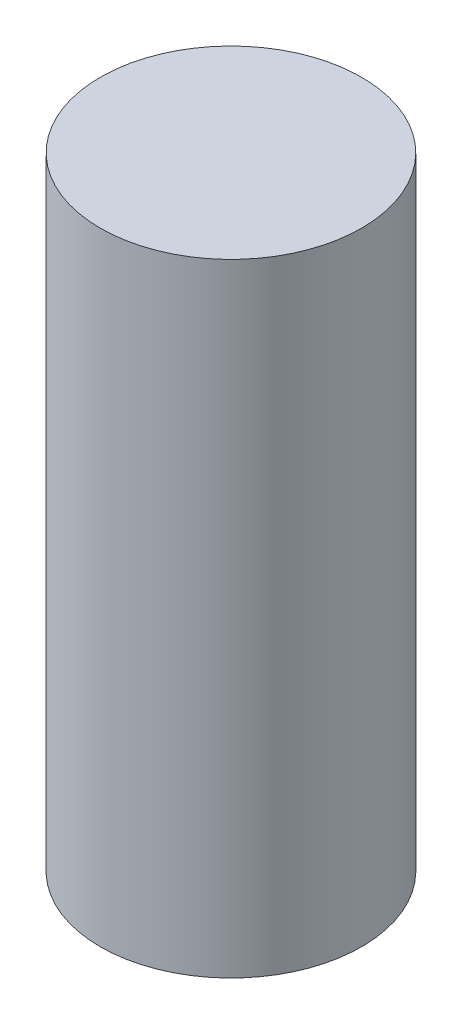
ISO-10303-21;
HEADER;
FILE_DESCRIPTION(('STEP AP214'),'2;1');
FILE_NAME('part.step','',(''),(''),'','','');
FILE_SCHEMA(('AUTOMOTIVE_DESIGN { 1 0 10303 214 1 1 1 1 }'));
ENDSEC;
DATA;
#1=APPLICATION_CONTEXT('core data for automotive mechanical design processes');
#2=APPLICATION_PROTOCOL_DEFINITION('international standard','automotive_design',2000,#1);
#3=PRODUCT_CONTEXT('',#1,'mechanical');
#4=PRODUCT('Part','Part','',(#3));
#5=PRODUCT_RELATED_PRODUCT_CATEGORY('part','',(#4));
#6=PRODUCT_DEFINITION_FORMATION('','',#4);
#7=PRODUCT_DEFINITION_CONTEXT('part definition',#1,'design');
#8=PRODUCT_DEFINITION('design','',#6,#7);
#9=PRODUCT_DEFINITION_SHAPE('','',#8);
#10=(LENGTH_UNIT() NAMED_UNIT(*) SI_UNIT(.MILLI.,.METRE.));
#11=(NAMED_UNIT(*) PLANE_ANGLE_UNIT() SI_UNIT($,.RADIAN.));
#12=(NAMED_UNIT(*) SI_UNIT($,.STERADIAN.) SOLID_ANGLE_UNIT());
#13=UNCERTAINTY_MEASURE_WITH_UNIT(LENGTH_MEASURE(1.E-05),#10,'distance_accuracy_value','');
#14=(GEOMETRIC_REPRESENTATION_CONTEXT(3) GLOBAL_UNCERTAINTY_ASSIGNED_CONTEXT((#13)) GLOBAL_UNIT_ASSIGNED_CONTEXT((#10,
#11,#12)) REPRESENTATION_CONTEXT('',''));
#15=CARTESIAN_POINT('',(0.,0.,0.));
#16=DIRECTION('',(0.,0.,1.));
#17=DIRECTION('',(1.,0.,0.));
#18=AXIS2_PLACEMENT_3D('',#15,#16,#17);
#19=CARTESIAN_POINT('',(0.,0.,0.));
#20=DIRECTION('',(0.,-1.,0.));
#21=DIRECTION('',(0.,0.,-1.));
#22=AXIS2_PLACEMENT_3D('',#19,#20,#21);
#23=PLANE('',#22);
#24=CARTESIAN_POINT('',(0.,0.,0.));
#25=DIRECTION('',(0.,1.,0.));
#26=DIRECTION('',(0.,0.,1.));
#27=AXIS2_PLACEMENT_3D('',#24,#25,#26);
#28=CIRCLE('',#27,3.15);
#29=CARTESIAN_POINT('',(0.,0.,3.15));
#30=VERTEX_POINT('',#29);
#31=EDGE_CURVE('E12',#30,#30,#28,.T.);
#32=ORIENTED_EDGE('',*,*,#31,.T.);
#33=EDGE_LOOP('',(#32));
#34=FACE_BOUND('',#33,.T.);
#35=ADVANCED_FACE('F42',(#34),#23,.F.);
#36=CARTESIAN_POINT('',(0.,28.6884754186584,0.));
#37=DIRECTION('',(0.,1.,0.));
#38=DIRECTION('',(0.,0.,1.));
#39=AXIS2_PLACEMENT_3D('',#36,#37,#38);
#40=CYLINDRICAL_SURFACE('',#39,3.15);
#41=ORIENTED_EDGE('',*,*,#31,.F.);
#42=EDGE_LOOP('',(#41));
#43=FACE_BOUND('',#42,.T.);
#44=CARTESIAN_POINT('',(0.,-15.,0.));
#45=DIRECTION('',(0.,1.,0.));
#46=DIRECTION('',(0.,0.,1.));
#47=AXIS2_PLACEMENT_3D('',#44,#45,#46);
#48=CIRCLE('',#47,3.15000000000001);
#49=CARTESIAN_POINT('',(0.,-15.,3.15000000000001));
#50=VERTEX_POINT('',#49);
#51=EDGE_CURVE('E48',#50,#50,#48,.T.);
#52=ORIENTED_EDGE('',*,*,#51,.T.);
#53=EDGE_LOOP('',(#52));
#54=FACE_BOUND('',#53,.T.);
#55=ADVANCED_FACE('F54',(#43,#54),#40,.T.);
#56=CARTESIAN_POINT('',(0.,-15.,-3.15000000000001));
#57=DIRECTION('',(0.,1.,0.));
#58=DIRECTION('',(0.,0.,1.));
#59=AXIS2_PLACEMENT_3D('',#56,#57,#58);
#60=PLANE('',#59);
#61=ORIENTED_EDGE('',*,*,#51,.F.);
#62=EDGE_LOOP('',(#61));
#63=FACE_BOUND('',#62,.T.);
#64=ADVANCED_FACE('F56',(#63),#60,.F.);
#65=CLOSED_SHELL('',(#35,#55,#64));
#66=MANIFOLD_SOLID_BREP('B2',#65);
#67=ADVANCED_BREP_SHAPE_REPRESENTATION('',(#18,#66),#14);
#68=SHAPE_DEFINITION_REPRESENTATION(#9,#67);
ENDSEC;
END-ISO-10303-21;
